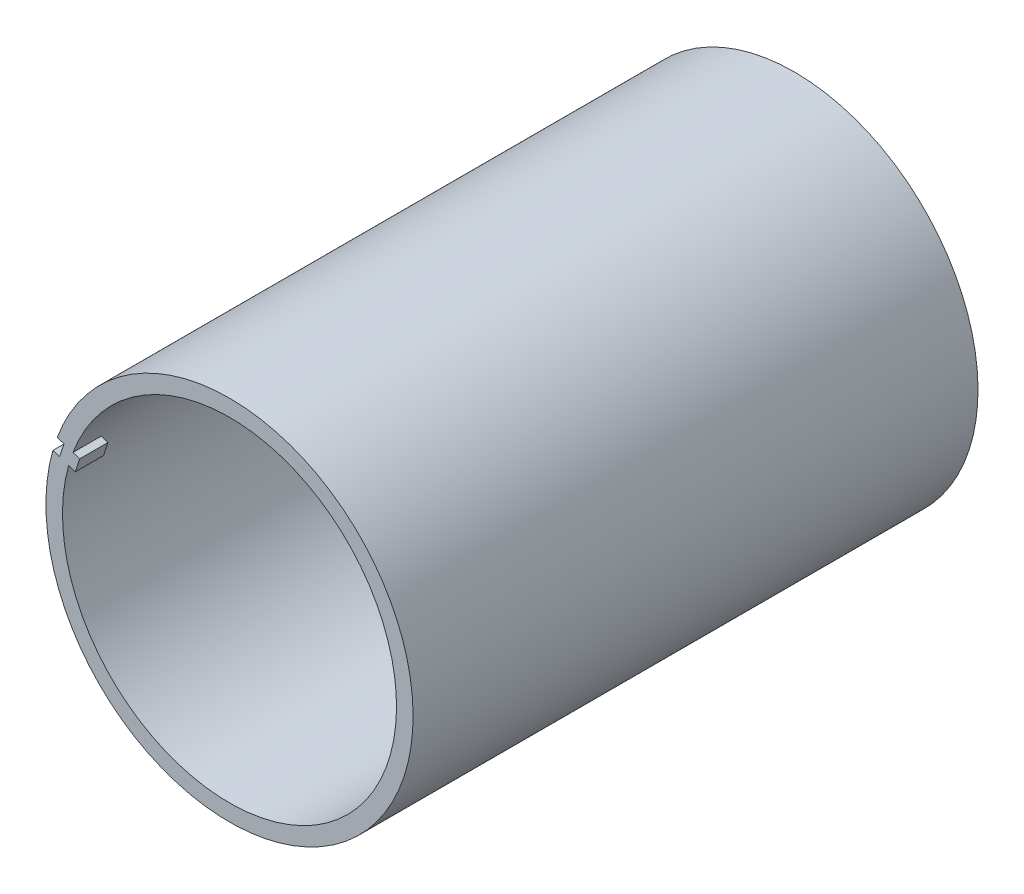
from build123d import *

# Parameters (mm, degrees)
BASE_EXTRUSION_DEPTH = 4
ESQUISSE2_R          = 25.998088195
ESQUISSE2_R_2        = 23.65
BOSS_EXTRU_1_DEPTH   = 72
BOSS_EXTRU_2_DEPTH   = 4


with BuildPart() as part:
    # Esquisse1 → Base-Extrusion (new body)
    with BuildSketch(Plane.XY):
        with BuildLine():
            Line((-23.447280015, 33.447057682), (-24.065314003, 31.544944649))
            Line((-24.065314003, 31.544944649), (-25.01637052, 31.853961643))
            ThreePointArc((-25.01637052, 31.853961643), (24.725651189, 16.743261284), (-24.398336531, 33.756074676))
            Line((-24.398336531, 33.756074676), (-23.447280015, 33.447057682))
        make_face()
        with BuildLine():
            Line((-21.212297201, 32.720867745), (-22.163353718, 33.029884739))
            ThreePointArc((-22.163353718, 33.029884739), (22.49248661, 17.468860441), (-22.781387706, 31.127771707))
            Line((-22.781387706, 31.127771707), (-21.83033119, 30.818754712))
            Line((-21.83033119, 30.818754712), (-21.212297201, 32.720867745))
        make_face(mode=Mode.SUBTRACT)
    extrude(amount=BASE_EXTRUSION_DEPTH)

    # Esquisse2 → Boss.-Extru.1 (add)
    with BuildSketch(Plane.XY.offset(4)):
        with Locations(Location((0, 24.777112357, 0), (0, 0, 164.204389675))):
            Circle(ESQUISSE2_R)
        with Locations(Location((0, 24.777112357, 0), (0, 0, 164.423377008))):
            Circle(ESQUISSE2_R_2, mode=Mode.SUBTRACT)
    extrude(amount=BOSS_EXTRU_1_DEPTH)

    # Esquisse6 → Boss.-Extru.2 (add)
    with BuildSketch(Plane.XY.offset(76)):
        with BuildLine():
            Line((-24.398336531, 33.756074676), (-23.447280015, 33.447057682))
            Line((-23.447280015, 33.447057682), (-24.065314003, 31.544944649))
            Line((-24.065314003, 31.544944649), (-25.01637052, 31.853961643))
            ThreePointArc((-25.01637052, 31.853961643), (24.725651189, 16.743261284), (-24.398336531, 33.756074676))
        make_face()
        with BuildLine():
            Line((-21.212297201, 32.720867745), (-22.163353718, 33.029884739))
            ThreePointArc((-22.163353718, 33.029884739), (22.49248661, 17.468860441), (-22.781387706, 31.127771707))
            Line((-22.781387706, 31.127771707), (-21.83033119, 30.818754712))
            Line((-21.83033119, 30.818754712), (-21.212297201, 32.720867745))
        make_face(mode=Mode.SUBTRACT)
    extrude(amount=BOSS_EXTRU_2_DEPTH)


solid = part.part
